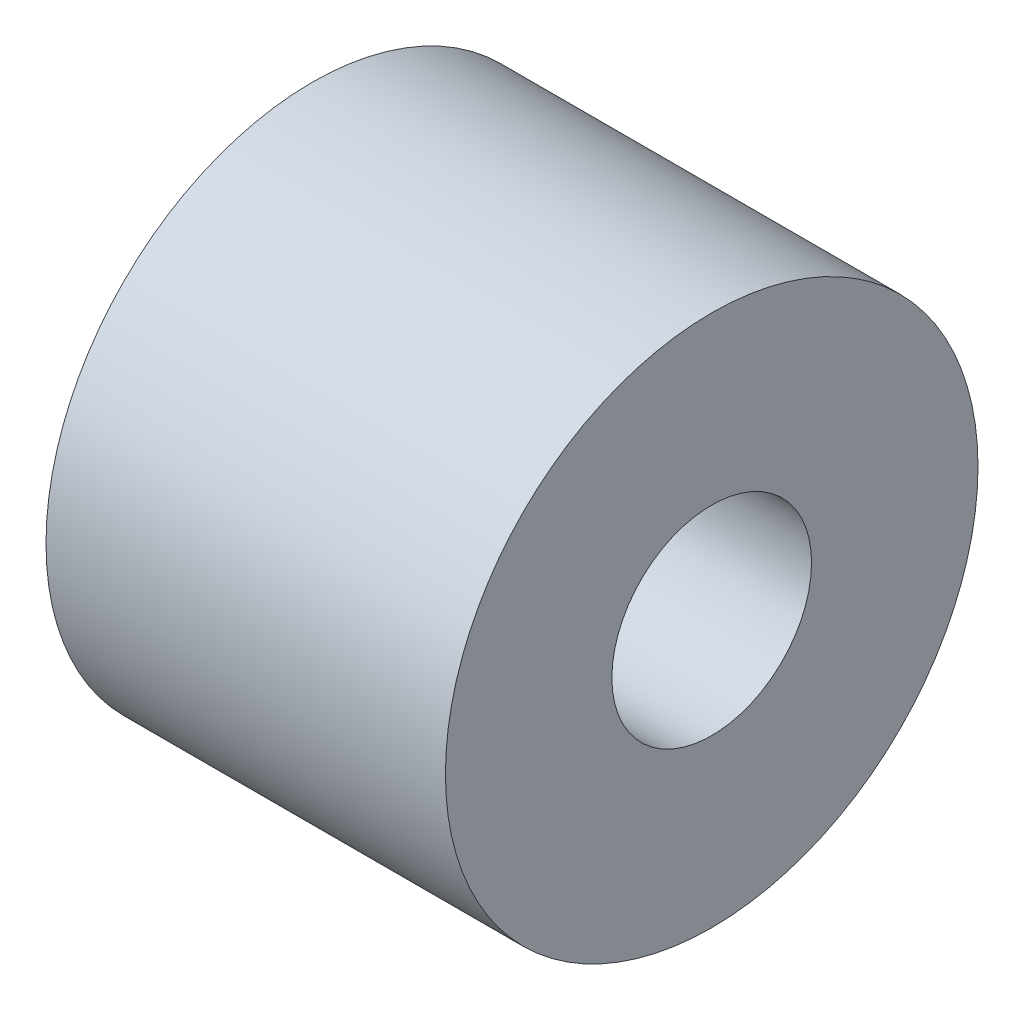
ISO-10303-21;
HEADER;
FILE_DESCRIPTION(('STEP AP214'),'2;1');
FILE_NAME('part.step','',(''),(''),'','','');
FILE_SCHEMA(('AUTOMOTIVE_DESIGN { 1 0 10303 214 1 1 1 1 }'));
ENDSEC;
DATA;
#1=APPLICATION_CONTEXT('core data for automotive mechanical design processes');
#2=APPLICATION_PROTOCOL_DEFINITION('international standard','automotive_design',2000,#1);
#3=PRODUCT_CONTEXT('',#1,'mechanical');
#4=PRODUCT('Part','Part','',(#3));
#5=PRODUCT_RELATED_PRODUCT_CATEGORY('part','',(#4));
#6=PRODUCT_DEFINITION_FORMATION('','',#4);
#7=PRODUCT_DEFINITION_CONTEXT('part definition',#1,'design');
#8=PRODUCT_DEFINITION('design','',#6,#7);
#9=PRODUCT_DEFINITION_SHAPE('','',#8);
#10=(LENGTH_UNIT() NAMED_UNIT(*) SI_UNIT(.MILLI.,.METRE.));
#11=(NAMED_UNIT(*) PLANE_ANGLE_UNIT() SI_UNIT($,.RADIAN.));
#12=(NAMED_UNIT(*) SI_UNIT($,.STERADIAN.) SOLID_ANGLE_UNIT());
#13=UNCERTAINTY_MEASURE_WITH_UNIT(LENGTH_MEASURE(1.E-05),#10,'distance_accuracy_value','');
#14=(GEOMETRIC_REPRESENTATION_CONTEXT(3) GLOBAL_UNCERTAINTY_ASSIGNED_CONTEXT((#13)) GLOBAL_UNIT_ASSIGNED_CONTEXT((#10,
#11,#12)) REPRESENTATION_CONTEXT('',''));
#15=CARTESIAN_POINT('',(0.,0.,0.));
#16=DIRECTION('',(0.,0.,1.));
#17=DIRECTION('',(1.,0.,0.));
#18=AXIS2_PLACEMENT_3D('',#15,#16,#17);
#19=CARTESIAN_POINT('',(-23.,5.,-260.));
#20=DIRECTION('',(1.,0.,0.));
#21=DIRECTION('',(0.,0.,-1.));
#22=AXIS2_PLACEMENT_3D('',#19,#20,#21);
#23=CYLINDRICAL_SURFACE('',#22,3.99999999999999);
#24=CARTESIAN_POINT('',(-23.,5.,-260.));
#25=DIRECTION('',(-1.,0.,0.));
#26=DIRECTION('',(0.,0.,1.));
#27=AXIS2_PLACEMENT_3D('',#24,#25,#26);
#28=CIRCLE('',#27,3.99999999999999);
#29=CARTESIAN_POINT('',(-23.,5.,-256.));
#30=VERTEX_POINT('',#29);
#31=EDGE_CURVE('E10',#30,#30,#28,.T.);
#32=ORIENTED_EDGE('',*,*,#31,.F.);
#33=EDGE_LOOP('',(#32));
#34=FACE_BOUND('',#33,.T.);
#35=CARTESIAN_POINT('',(-17.,5.,-260.));
#36=DIRECTION('',(-1.,0.,0.));
#37=DIRECTION('',(0.,0.,1.));
#38=AXIS2_PLACEMENT_3D('',#35,#36,#37);
#39=CIRCLE('',#38,3.99999999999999);
#40=CARTESIAN_POINT('',(-17.,5.,-256.));
#41=VERTEX_POINT('',#40);
#42=EDGE_CURVE('E36',#41,#41,#39,.T.);
#43=ORIENTED_EDGE('',*,*,#42,.T.);
#44=EDGE_LOOP('',(#43));
#45=FACE_BOUND('',#44,.T.);
#46=ADVANCED_FACE('F29',(#34,#45),#23,.T.);
#47=CARTESIAN_POINT('',(-23.,5.,-260.));
#48=DIRECTION('',(-1.,0.,0.));
#49=DIRECTION('',(0.,0.,1.));
#50=AXIS2_PLACEMENT_3D('',#47,#48,#49);
#51=PLANE('',#50);
#52=CARTESIAN_POINT('',(-23.,5.,-260.));
#53=DIRECTION('',(-1.,0.,0.));
#54=DIRECTION('',(0.,0.,1.));
#55=AXIS2_PLACEMENT_3D('',#52,#53,#54);
#56=CIRCLE('',#55,1.50000000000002);
#57=CARTESIAN_POINT('',(-23.,5.,-258.5));
#58=VERTEX_POINT('',#57);
#59=EDGE_CURVE('E42',#58,#58,#56,.T.);
#60=ORIENTED_EDGE('',*,*,#59,.F.);
#61=EDGE_LOOP('',(#60));
#62=FACE_BOUND('',#61,.T.);
#63=ORIENTED_EDGE('',*,*,#31,.T.);
#64=EDGE_LOOP('',(#63));
#65=FACE_BOUND('',#64,.T.);
#66=ADVANCED_FACE('F58',(#62,#65),#51,.T.);
#67=CARTESIAN_POINT('',(-17.,5.,-260.));
#68=DIRECTION('',(-1.,0.,0.));
#69=DIRECTION('',(0.,0.,1.));
#70=AXIS2_PLACEMENT_3D('',#67,#68,#69);
#71=PLANE('',#70);
#72=CARTESIAN_POINT('',(-17.,5.,-260.));
#73=DIRECTION('',(-1.,0.,0.));
#74=DIRECTION('',(0.,0.,1.));
#75=AXIS2_PLACEMENT_3D('',#72,#73,#74);
#76=CIRCLE('',#75,1.50000000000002);
#77=CARTESIAN_POINT('',(-17.,5.,-258.5));
#78=VERTEX_POINT('',#77);
#79=EDGE_CURVE('E32',#78,#78,#76,.T.);
#80=ORIENTED_EDGE('',*,*,#79,.T.);
#81=EDGE_LOOP('',(#80));
#82=FACE_BOUND('',#81,.T.);
#83=ORIENTED_EDGE('',*,*,#42,.F.);
#84=EDGE_LOOP('',(#83));
#85=FACE_BOUND('',#84,.T.);
#86=ADVANCED_FACE('F49',(#82,#85),#71,.F.);
#87=CARTESIAN_POINT('',(90.,5.,-260.));
#88=DIRECTION('',(-1.,0.,0.));
#89=DIRECTION('',(0.,0.,1.));
#90=AXIS2_PLACEMENT_3D('',#87,#88,#89);
#91=CYLINDRICAL_SURFACE('',#90,1.50000000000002);
#92=ORIENTED_EDGE('',*,*,#59,.T.);
#93=EDGE_LOOP('',(#92));
#94=FACE_BOUND('',#93,.T.);
#95=ORIENTED_EDGE('',*,*,#79,.F.);
#96=EDGE_LOOP('',(#95));
#97=FACE_BOUND('',#96,.T.);
#98=ADVANCED_FACE('F52',(#94,#97),#91,.F.);
#99=CLOSED_SHELL('',(#46,#66,#86,#98));
#100=MANIFOLD_SOLID_BREP('B2',#99);
#101=ADVANCED_BREP_SHAPE_REPRESENTATION('',(#18,#100),#14);
#102=SHAPE_DEFINITION_REPRESENTATION(#9,#101);
ENDSEC;
END-ISO-10303-21;
